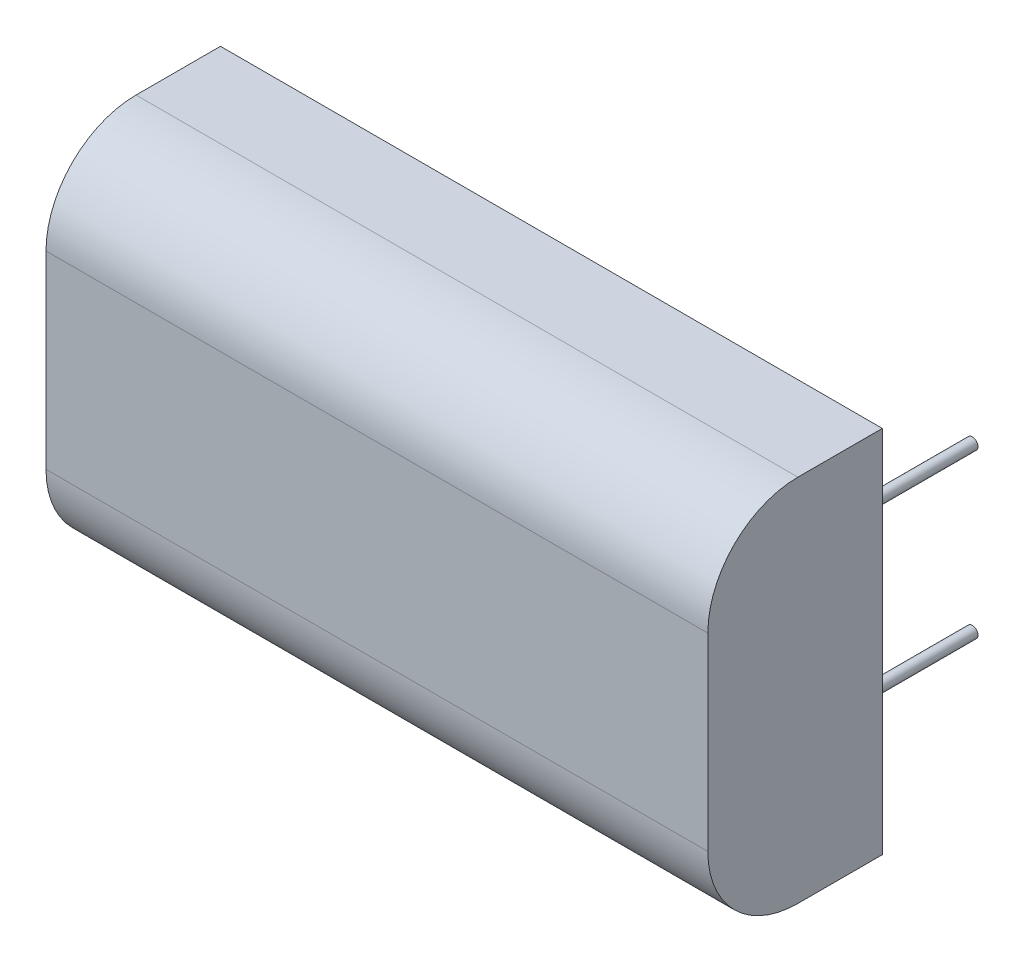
from build123d import *

# Parameters (mm, degrees)
SKETCH1_W           = 15.5
SKETCH1_H           = 32.8
BOSS_EXTRUDE1_DEPTH = 29.4
FILLET1_R           = 8
SKETCH2_R           = 0.5
BOSS_EXTRUDE2_DEPTH = 12


with BuildPart() as part:
    # Sketch1 → Boss-Extrude1 (new, symmetric)
    with BuildSketch(Plane(origin=(0, 0, 0), x_dir=(0, 0, -1), z_dir=(1, 0, 0))):
        Rectangle(SKETCH1_W, SKETCH1_H)
    extrude(amount=BOSS_EXTRUDE1_DEPTH, both=True)

    # Fillet1
    fillet1_edges = [part.edges().sort_by_distance(p)[0] for p in [
        (0, 16.4, 7.75),
        (0, -16.4, 7.75),
    ]]
    fillet(fillet1_edges, radius=FILLET1_R)

    # Sketch2 → Boss-Extrude2 (add)
    with BuildSketch(Plane(origin=(0, 0, -7.75), x_dir=(-1, 0, 0), z_dir=(0, 0, -1))):
        with Locations(Location((-25.4, 7.25, 0), (0, 0, 180))):
            Circle(SKETCH2_R)
        with Locations(Location((-25.4, -7.25, 0), (0, 0, 180))):
            Circle(SKETCH2_R)
    extrude(amount=BOSS_EXTRUDE2_DEPTH)


solid = part.part
